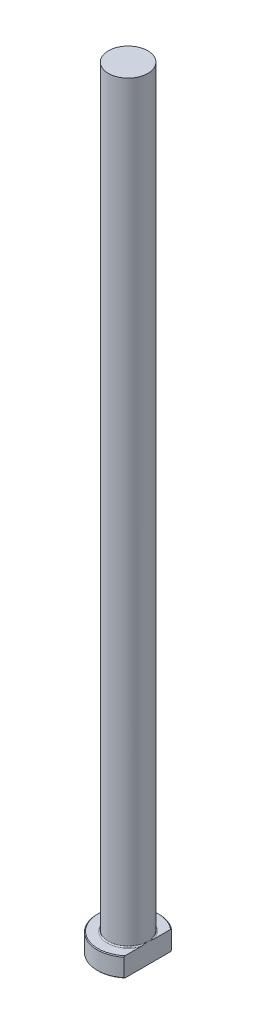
from build123d import *
from build123d.topology import SkipClean

# Parameters (mm, degrees)
CHAMFER1_SIZE = 0.2
FILLET1_R     = 0.3
KEY_DEPTH     = 201.319744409


with BuildPart() as part:
    # Sketch1 → Revolve1 (revolve)
    with BuildSketch(Plane.XY, mode=Mode.PRIVATE) as revolve1_sk:
        Polygon((0, 0), (-8, 0), (-8, 5), (-5.1, 5), (-5.1, 200), (0, 200), align=None)
    revolve(revolve1_sk.sketch.rotate(Axis((0, 259.958771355, 0), (0, -1, 0)), 270), axis=Axis((0, 259.958771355, 0), (0, -1, 0)))

    # Chamfer1
    chamfer1_edges = [part.edges().sort_by_distance(p)[0] for p in [
        (0, 5, -8),
        (0, 0, -8),
    ]]
    chamfer(chamfer1_edges, length=CHAMFER1_SIZE)

    # Fillet1
    fillet1_edges = [part.edges().sort_by_distance(p)[0] for p in [
        (0, 5, -5.1),
    ]]
    fillet(fillet1_edges, radius=FILLET1_R)

    # Sketch2 → KEY (cut, through all)
    with SkipClean():  # the faces are left unmerged after this step: merging them gives an invalid solid
        with BuildSketch(Plane(origin=(0, 0, 0), x_dir=(1, 0, 0), z_dir=(0, 1, 0))):
            with BuildLine():
                Line((5.1, 6.163602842), (5.1, -6.163602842))
                ThreePointArc((5.1, -6.163602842), (8, 0), (5.1, 6.163602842))
            make_face()
        extrude(amount=KEY_DEPTH, mode=Mode.SUBTRACT)


solid = part.part
